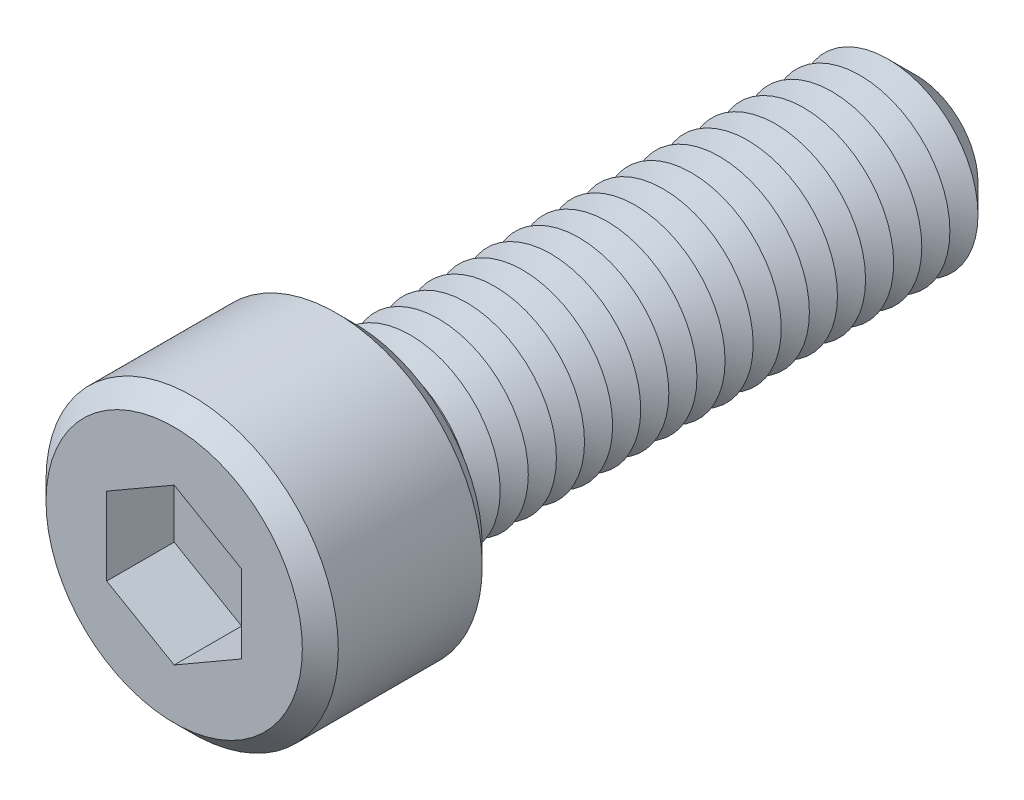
ISO-10303-21;
HEADER;
FILE_DESCRIPTION(('STEP AP214'),'2;1');
FILE_NAME('part.step','',(''),(''),'','','');
FILE_SCHEMA(('AUTOMOTIVE_DESIGN { 1 0 10303 214 1 1 1 1 }'));
ENDSEC;
DATA;
#1=APPLICATION_CONTEXT('core data for automotive mechanical design processes');
#2=APPLICATION_PROTOCOL_DEFINITION('international standard','automotive_design',2000,#1);
#3=PRODUCT_CONTEXT('',#1,'mechanical');
#4=PRODUCT('Part','Part','',(#3));
#5=PRODUCT_RELATED_PRODUCT_CATEGORY('part','',(#4));
#6=PRODUCT_DEFINITION_FORMATION('','',#4);
#7=PRODUCT_DEFINITION_CONTEXT('part definition',#1,'design');
#8=PRODUCT_DEFINITION('design','',#6,#7);
#9=PRODUCT_DEFINITION_SHAPE('','',#8);
#10=(LENGTH_UNIT() NAMED_UNIT(*) SI_UNIT(.MILLI.,.METRE.));
#11=(NAMED_UNIT(*) PLANE_ANGLE_UNIT() SI_UNIT($,.RADIAN.));
#12=(NAMED_UNIT(*) SI_UNIT($,.STERADIAN.) SOLID_ANGLE_UNIT());
#13=UNCERTAINTY_MEASURE_WITH_UNIT(LENGTH_MEASURE(1.E-05),#10,'distance_accuracy_value','');
#14=(GEOMETRIC_REPRESENTATION_CONTEXT(3) GLOBAL_UNCERTAINTY_ASSIGNED_CONTEXT((#13)) GLOBAL_UNIT_ASSIGNED_CONTEXT((#10,
#11,#12)) REPRESENTATION_CONTEXT('',''));
#15=CARTESIAN_POINT('',(0.,0.,0.));
#16=DIRECTION('',(0.,0.,1.));
#17=DIRECTION('',(1.,0.,0.));
#18=AXIS2_PLACEMENT_3D('',#15,#16,#17);
#19=CARTESIAN_POINT('',(0.,0.,8.));
#20=DIRECTION('',(0.,0.,-1.));
#21=DIRECTION('',(-1.,0.,0.));
#22=AXIS2_PLACEMENT_3D('',#19,#20,#21);
#23=CYLINDRICAL_SURFACE('',#22,6.5);
#24=CARTESIAN_POINT('',(0.,0.,0.800000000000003));
#25=DIRECTION('',(0.,0.,1.));
#26=DIRECTION('',(1.,0.,0.));
#27=AXIS2_PLACEMENT_3D('',#24,#25,#26);
#28=CIRCLE('',#27,6.5);
#29=CARTESIAN_POINT('',(6.5,0.,0.800000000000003));
#30=VERTEX_POINT('',#29);
#31=EDGE_CURVE('E328',#30,#30,#28,.T.);
#32=ORIENTED_EDGE('',*,*,#31,.T.);
#33=EDGE_LOOP('',(#32));
#34=FACE_BOUND('',#33,.T.);
#35=CARTESIAN_POINT('',(0.,0.,7.2));
#36=DIRECTION('',(0.,0.,1.));
#37=DIRECTION('',(1.,0.,0.));
#38=AXIS2_PLACEMENT_3D('',#35,#36,#37);
#39=CIRCLE('',#38,6.5);
#40=CARTESIAN_POINT('',(6.5,0.,7.2));
#41=VERTEX_POINT('',#40);
#42=EDGE_CURVE('E324',#41,#41,#39,.F.);
#43=ORIENTED_EDGE('',*,*,#42,.T.);
#44=EDGE_LOOP('',(#43));
#45=FACE_BOUND('',#44,.T.);
#46=ADVANCED_FACE('F39',(#34,#45),#23,.T.);
#47=CARTESIAN_POINT('',(0.,0.,8.));
#48=DIRECTION('',(0.,0.,1.));
#49=DIRECTION('',(1.,0.,0.));
#50=AXIS2_PLACEMENT_3D('',#47,#48,#49);
#51=PLANE('',#50);
#52=CARTESIAN_POINT('',(0.,0.,8.));
#53=DIRECTION('',(0.,0.,1.));
#54=DIRECTION('',(1.,0.,0.));
#55=AXIS2_PLACEMENT_3D('',#52,#53,#54);
#56=CIRCLE('',#55,5.69999999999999);
#57=CARTESIAN_POINT('',(5.69999999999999,0.,8.));
#58=VERTEX_POINT('',#57);
#59=EDGE_CURVE('E11',#58,#58,#56,.T.);
#60=ORIENTED_EDGE('',*,*,#59,.T.);
#61=EDGE_LOOP('',(#60));
#62=FACE_BOUND('',#61,.T.);
#63=DIRECTION('',(-0.866025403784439,0.5,0.));
#64=VECTOR('',#63,1.);
#65=CARTESIAN_POINT('',(3.,1.73205080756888,8.));
#66=LINE('',#65,#64);
#67=CARTESIAN_POINT('',(3.,1.73205080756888,8.));
#68=VERTEX_POINT('',#67);
#69=CARTESIAN_POINT('',(0.,3.46410161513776,8.));
#70=VERTEX_POINT('',#69);
#71=EDGE_CURVE('E55',#68,#70,#66,.T.);
#72=ORIENTED_EDGE('',*,*,#71,.F.);
#73=DIRECTION('',(0.,1.,0.));
#74=VECTOR('',#73,1.);
#75=CARTESIAN_POINT('',(3.,-1.73205080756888,8.));
#76=LINE('',#75,#74);
#77=CARTESIAN_POINT('',(3.,-1.73205080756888,8.));
#78=VERTEX_POINT('',#77);
#79=EDGE_CURVE('E150',#78,#68,#76,.T.);
#80=ORIENTED_EDGE('',*,*,#79,.F.);
#81=DIRECTION('',(0.866025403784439,0.5,0.));
#82=VECTOR('',#81,1.);
#83=CARTESIAN_POINT('',(0.,-3.46410161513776,8.));
#84=LINE('',#83,#82);
#85=CARTESIAN_POINT('',(0.,-3.46410161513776,8.));
#86=VERTEX_POINT('',#85);
#87=EDGE_CURVE('E147',#86,#78,#84,.T.);
#88=ORIENTED_EDGE('',*,*,#87,.F.);
#89=DIRECTION('',(0.866025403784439,-0.5,0.));
#90=VECTOR('',#89,1.);
#91=CARTESIAN_POINT('',(-3.,-1.73205080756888,8.));
#92=LINE('',#91,#90);
#93=CARTESIAN_POINT('',(-3.,-1.73205080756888,8.));
#94=VERTEX_POINT('',#93);
#95=EDGE_CURVE('E103',#94,#86,#92,.T.);
#96=ORIENTED_EDGE('',*,*,#95,.F.);
#97=DIRECTION('',(0.,-1.,0.));
#98=VECTOR('',#97,1.);
#99=CARTESIAN_POINT('',(-3.,1.73205080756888,8.));
#100=LINE('',#99,#98);
#101=CARTESIAN_POINT('',(-3.,1.73205080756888,8.));
#102=VERTEX_POINT('',#101);
#103=EDGE_CURVE('E141',#102,#94,#100,.T.);
#104=ORIENTED_EDGE('',*,*,#103,.F.);
#105=DIRECTION('',(-0.866025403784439,-0.5,0.));
#106=VECTOR('',#105,1.);
#107=CARTESIAN_POINT('',(0.,3.46410161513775,8.));
#108=LINE('',#107,#106);
#109=EDGE_CURVE('E136',#70,#102,#108,.T.);
#110=ORIENTED_EDGE('',*,*,#109,.F.);
#111=EDGE_LOOP('',(#72,#80,#88,#96,#104,#110));
#112=FACE_BOUND('',#111,.T.);
#113=ADVANCED_FACE('F346',(#62,#112),#51,.T.);
#114=CARTESIAN_POINT('',(0.,0.,0.));
#115=DIRECTION('',(0.,0.,1.));
#116=DIRECTION('',(1.,0.,0.));
#117=AXIS2_PLACEMENT_3D('',#114,#115,#116);
#118=PLANE('',#117);
#119=CARTESIAN_POINT('',(0.,0.,0.));
#120=DIRECTION('',(0.,0.,1.));
#121=DIRECTION('',(1.,0.,0.));
#122=AXIS2_PLACEMENT_3D('',#119,#120,#121);
#123=CIRCLE('',#122,5.7);
#124=CARTESIAN_POINT('',(5.7,0.,0.));
#125=VERTEX_POINT('',#124);
#126=EDGE_CURVE('E48',#125,#125,#123,.F.);
#127=ORIENTED_EDGE('',*,*,#126,.T.);
#128=EDGE_LOOP('',(#127));
#129=FACE_BOUND('',#128,.T.);
#130=CARTESIAN_POINT('',(0.,0.,0.));
#131=DIRECTION('',(0.,0.,1.));
#132=DIRECTION('',(1.,0.,0.));
#133=AXIS2_PLACEMENT_3D('',#130,#131,#132);
#134=CIRCLE('',#133,4.);
#135=CARTESIAN_POINT('',(4.,0.,0.));
#136=VERTEX_POINT('',#135);
#137=EDGE_CURVE('E316',#136,#136,#134,.T.);
#138=ORIENTED_EDGE('',*,*,#137,.T.);
#139=EDGE_LOOP('',(#138));
#140=FACE_BOUND('',#139,.T.);
#141=ADVANCED_FACE('F335',(#129,#140),#118,.F.);
#142=CARTESIAN_POINT('',(0.,0.,0.));
#143=DIRECTION('',(0.,0.,1.));
#144=DIRECTION('',(1.,0.,0.));
#145=AXIS2_PLACEMENT_3D('',#142,#143,#144);
#146=CONICAL_SURFACE('',#145,4.,1.0471975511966);
#147=CARTESIAN_POINT('',(0.,0.,-0.625000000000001));
#148=DIRECTION('',(0.,0.,1.));
#149=DIRECTION('',(1.,0.,0.));
#150=AXIS2_PLACEMENT_3D('',#147,#148,#149);
#151=CIRCLE('',#150,2.91746824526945);
#152=CARTESIAN_POINT('',(2.91746824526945,0.,-0.625000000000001));
#153=VERTEX_POINT('',#152);
#154=EDGE_CURVE('E312',#153,#153,#151,.T.);
#155=ORIENTED_EDGE('',*,*,#154,.T.);
#156=EDGE_LOOP('',(#155));
#157=FACE_BOUND('',#156,.T.);
#158=ORIENTED_EDGE('',*,*,#137,.F.);
#159=EDGE_LOOP('',(#158));
#160=FACE_BOUND('',#159,.T.);
#161=ADVANCED_FACE('F548',(#157,#160),#146,.T.);
#162=CARTESIAN_POINT('',(0.,0.,-0.625000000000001));
#163=DIRECTION('',(0.,0.,-1.));
#164=DIRECTION('',(-1.,0.,0.));
#165=AXIS2_PLACEMENT_3D('',#162,#163,#164);
#166=CONICAL_SURFACE('',#165,2.91746824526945,1.0471975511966);
#167=CARTESIAN_POINT('',(0.,0.,-1.25));
#168=DIRECTION('',(0.,0.,1.));
#169=DIRECTION('',(1.,0.,0.));
#170=AXIS2_PLACEMENT_3D('',#167,#168,#169);
#171=CIRCLE('',#170,4.);
#172=CARTESIAN_POINT('',(4.,0.,-1.25));
#173=VERTEX_POINT('',#172);
#174=EDGE_CURVE('E308',#173,#173,#171,.T.);
#175=ORIENTED_EDGE('',*,*,#174,.T.);
#176=EDGE_LOOP('',(#175));
#177=FACE_BOUND('',#176,.T.);
#178=ORIENTED_EDGE('',*,*,#154,.F.);
#179=EDGE_LOOP('',(#178));
#180=FACE_BOUND('',#179,.T.);
#181=ADVANCED_FACE('F544',(#177,#180),#166,.T.);
#182=CARTESIAN_POINT('',(0.,0.,-1.25));
#183=DIRECTION('',(0.,0.,1.));
#184=DIRECTION('',(1.,0.,0.));
#185=AXIS2_PLACEMENT_3D('',#182,#183,#184);
#186=CONICAL_SURFACE('',#185,4.,1.0471975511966);
#187=CARTESIAN_POINT('',(0.,0.,-1.875));
#188=DIRECTION('',(0.,0.,1.));
#189=DIRECTION('',(1.,0.,0.));
#190=AXIS2_PLACEMENT_3D('',#187,#188,#189);
#191=CIRCLE('',#190,2.91746824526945);
#192=CARTESIAN_POINT('',(2.91746824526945,0.,-1.875));
#193=VERTEX_POINT('',#192);
#194=EDGE_CURVE('E304',#193,#193,#191,.T.);
#195=ORIENTED_EDGE('',*,*,#194,.T.);
#196=EDGE_LOOP('',(#195));
#197=FACE_BOUND('',#196,.T.);
#198=ORIENTED_EDGE('',*,*,#174,.F.);
#199=EDGE_LOOP('',(#198));
#200=FACE_BOUND('',#199,.T.);
#201=ADVANCED_FACE('F540',(#197,#200),#186,.T.);
#202=CARTESIAN_POINT('',(0.,0.,-1.875));
#203=DIRECTION('',(0.,0.,-1.));
#204=DIRECTION('',(-1.,0.,0.));
#205=AXIS2_PLACEMENT_3D('',#202,#203,#204);
#206=CONICAL_SURFACE('',#205,2.91746824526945,1.0471975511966);
#207=CARTESIAN_POINT('',(0.,0.,-2.5));
#208=DIRECTION('',(0.,0.,1.));
#209=DIRECTION('',(1.,0.,0.));
#210=AXIS2_PLACEMENT_3D('',#207,#208,#209);
#211=CIRCLE('',#210,4.);
#212=CARTESIAN_POINT('',(4.,0.,-2.5));
#213=VERTEX_POINT('',#212);
#214=EDGE_CURVE('E300',#213,#213,#211,.T.);
#215=ORIENTED_EDGE('',*,*,#214,.T.);
#216=EDGE_LOOP('',(#215));
#217=FACE_BOUND('',#216,.T.);
#218=ORIENTED_EDGE('',*,*,#194,.F.);
#219=EDGE_LOOP('',(#218));
#220=FACE_BOUND('',#219,.T.);
#221=ADVANCED_FACE('F536',(#217,#220),#206,.T.);
#222=CARTESIAN_POINT('',(0.,0.,-2.5));
#223=DIRECTION('',(0.,0.,1.));
#224=DIRECTION('',(1.,0.,0.));
#225=AXIS2_PLACEMENT_3D('',#222,#223,#224);
#226=CONICAL_SURFACE('',#225,4.,1.0471975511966);
#227=CARTESIAN_POINT('',(0.,0.,-3.125));
#228=DIRECTION('',(0.,0.,1.));
#229=DIRECTION('',(1.,0.,0.));
#230=AXIS2_PLACEMENT_3D('',#227,#228,#229);
#231=CIRCLE('',#230,2.91746824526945);
#232=CARTESIAN_POINT('',(2.91746824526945,0.,-3.125));
#233=VERTEX_POINT('',#232);
#234=EDGE_CURVE('E296',#233,#233,#231,.T.);
#235=ORIENTED_EDGE('',*,*,#234,.T.);
#236=EDGE_LOOP('',(#235));
#237=FACE_BOUND('',#236,.T.);
#238=ORIENTED_EDGE('',*,*,#214,.F.);
#239=EDGE_LOOP('',(#238));
#240=FACE_BOUND('',#239,.T.);
#241=ADVANCED_FACE('F532',(#237,#240),#226,.T.);
#242=CARTESIAN_POINT('',(0.,0.,-3.125));
#243=DIRECTION('',(0.,0.,-1.));
#244=DIRECTION('',(-1.,0.,0.));
#245=AXIS2_PLACEMENT_3D('',#242,#243,#244);
#246=CONICAL_SURFACE('',#245,2.91746824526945,1.0471975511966);
#247=CARTESIAN_POINT('',(0.,0.,-3.75));
#248=DIRECTION('',(0.,0.,1.));
#249=DIRECTION('',(1.,0.,0.));
#250=AXIS2_PLACEMENT_3D('',#247,#248,#249);
#251=CIRCLE('',#250,4.);
#252=CARTESIAN_POINT('',(4.,0.,-3.75));
#253=VERTEX_POINT('',#252);
#254=EDGE_CURVE('E292',#253,#253,#251,.T.);
#255=ORIENTED_EDGE('',*,*,#254,.T.);
#256=EDGE_LOOP('',(#255));
#257=FACE_BOUND('',#256,.T.);
#258=ORIENTED_EDGE('',*,*,#234,.F.);
#259=EDGE_LOOP('',(#258));
#260=FACE_BOUND('',#259,.T.);
#261=ADVANCED_FACE('F528',(#257,#260),#246,.T.);
#262=CARTESIAN_POINT('',(0.,0.,-3.75));
#263=DIRECTION('',(0.,0.,1.));
#264=DIRECTION('',(1.,0.,0.));
#265=AXIS2_PLACEMENT_3D('',#262,#263,#264);
#266=CONICAL_SURFACE('',#265,4.,1.0471975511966);
#267=CARTESIAN_POINT('',(0.,0.,-4.375));
#268=DIRECTION('',(0.,0.,1.));
#269=DIRECTION('',(1.,0.,0.));
#270=AXIS2_PLACEMENT_3D('',#267,#268,#269);
#271=CIRCLE('',#270,2.91746824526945);
#272=CARTESIAN_POINT('',(2.91746824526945,0.,-4.375));
#273=VERTEX_POINT('',#272);
#274=EDGE_CURVE('E288',#273,#273,#271,.T.);
#275=ORIENTED_EDGE('',*,*,#274,.T.);
#276=EDGE_LOOP('',(#275));
#277=FACE_BOUND('',#276,.T.);
#278=ORIENTED_EDGE('',*,*,#254,.F.);
#279=EDGE_LOOP('',(#278));
#280=FACE_BOUND('',#279,.T.);
#281=ADVANCED_FACE('F524',(#277,#280),#266,.T.);
#282=CARTESIAN_POINT('',(0.,0.,-4.375));
#283=DIRECTION('',(0.,0.,-1.));
#284=DIRECTION('',(-1.,0.,0.));
#285=AXIS2_PLACEMENT_3D('',#282,#283,#284);
#286=CONICAL_SURFACE('',#285,2.91746824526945,1.0471975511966);
#287=CARTESIAN_POINT('',(0.,0.,-5.));
#288=DIRECTION('',(0.,0.,1.));
#289=DIRECTION('',(1.,0.,0.));
#290=AXIS2_PLACEMENT_3D('',#287,#288,#289);
#291=CIRCLE('',#290,4.);
#292=CARTESIAN_POINT('',(4.,0.,-5.));
#293=VERTEX_POINT('',#292);
#294=EDGE_CURVE('E284',#293,#293,#291,.T.);
#295=ORIENTED_EDGE('',*,*,#294,.T.);
#296=EDGE_LOOP('',(#295));
#297=FACE_BOUND('',#296,.T.);
#298=ORIENTED_EDGE('',*,*,#274,.F.);
#299=EDGE_LOOP('',(#298));
#300=FACE_BOUND('',#299,.T.);
#301=ADVANCED_FACE('F520',(#297,#300),#286,.T.);
#302=CARTESIAN_POINT('',(0.,0.,-5.));
#303=DIRECTION('',(0.,0.,1.));
#304=DIRECTION('',(1.,0.,0.));
#305=AXIS2_PLACEMENT_3D('',#302,#303,#304);
#306=CONICAL_SURFACE('',#305,4.,1.0471975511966);
#307=CARTESIAN_POINT('',(0.,0.,-5.625));
#308=DIRECTION('',(0.,0.,1.));
#309=DIRECTION('',(1.,0.,0.));
#310=AXIS2_PLACEMENT_3D('',#307,#308,#309);
#311=CIRCLE('',#310,2.91746824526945);
#312=CARTESIAN_POINT('',(2.91746824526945,0.,-5.625));
#313=VERTEX_POINT('',#312);
#314=EDGE_CURVE('E280',#313,#313,#311,.T.);
#315=ORIENTED_EDGE('',*,*,#314,.T.);
#316=EDGE_LOOP('',(#315));
#317=FACE_BOUND('',#316,.T.);
#318=ORIENTED_EDGE('',*,*,#294,.F.);
#319=EDGE_LOOP('',(#318));
#320=FACE_BOUND('',#319,.T.);
#321=ADVANCED_FACE('F516',(#317,#320),#306,.T.);
#322=CARTESIAN_POINT('',(0.,0.,-5.625));
#323=DIRECTION('',(0.,0.,-1.));
#324=DIRECTION('',(-1.,0.,0.));
#325=AXIS2_PLACEMENT_3D('',#322,#323,#324);
#326=CONICAL_SURFACE('',#325,2.91746824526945,1.0471975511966);
#327=CARTESIAN_POINT('',(0.,0.,-6.25));
#328=DIRECTION('',(0.,0.,1.));
#329=DIRECTION('',(1.,0.,0.));
#330=AXIS2_PLACEMENT_3D('',#327,#328,#329);
#331=CIRCLE('',#330,4.);
#332=CARTESIAN_POINT('',(4.,0.,-6.25));
#333=VERTEX_POINT('',#332);
#334=EDGE_CURVE('E276',#333,#333,#331,.T.);
#335=ORIENTED_EDGE('',*,*,#334,.T.);
#336=EDGE_LOOP('',(#335));
#337=FACE_BOUND('',#336,.T.);
#338=ORIENTED_EDGE('',*,*,#314,.F.);
#339=EDGE_LOOP('',(#338));
#340=FACE_BOUND('',#339,.T.);
#341=ADVANCED_FACE('F512',(#337,#340),#326,.T.);
#342=CARTESIAN_POINT('',(0.,0.,-6.25));
#343=DIRECTION('',(0.,0.,1.));
#344=DIRECTION('',(1.,0.,0.));
#345=AXIS2_PLACEMENT_3D('',#342,#343,#344);
#346=CONICAL_SURFACE('',#345,4.,1.0471975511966);
#347=CARTESIAN_POINT('',(0.,0.,-6.875));
#348=DIRECTION('',(0.,0.,1.));
#349=DIRECTION('',(1.,0.,0.));
#350=AXIS2_PLACEMENT_3D('',#347,#348,#349);
#351=CIRCLE('',#350,2.91746824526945);
#352=CARTESIAN_POINT('',(2.91746824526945,0.,-6.875));
#353=VERTEX_POINT('',#352);
#354=EDGE_CURVE('E272',#353,#353,#351,.T.);
#355=ORIENTED_EDGE('',*,*,#354,.T.);
#356=EDGE_LOOP('',(#355));
#357=FACE_BOUND('',#356,.T.);
#358=ORIENTED_EDGE('',*,*,#334,.F.);
#359=EDGE_LOOP('',(#358));
#360=FACE_BOUND('',#359,.T.);
#361=ADVANCED_FACE('F508',(#357,#360),#346,.T.);
#362=CARTESIAN_POINT('',(0.,0.,-6.875));
#363=DIRECTION('',(0.,0.,-1.));
#364=DIRECTION('',(-1.,0.,0.));
#365=AXIS2_PLACEMENT_3D('',#362,#363,#364);
#366=CONICAL_SURFACE('',#365,2.91746824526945,1.0471975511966);
#367=CARTESIAN_POINT('',(0.,0.,-7.5));
#368=DIRECTION('',(0.,0.,1.));
#369=DIRECTION('',(1.,0.,0.));
#370=AXIS2_PLACEMENT_3D('',#367,#368,#369);
#371=CIRCLE('',#370,4.);
#372=CARTESIAN_POINT('',(4.,0.,-7.5));
#373=VERTEX_POINT('',#372);
#374=EDGE_CURVE('E268',#373,#373,#371,.T.);
#375=ORIENTED_EDGE('',*,*,#374,.T.);
#376=EDGE_LOOP('',(#375));
#377=FACE_BOUND('',#376,.T.);
#378=ORIENTED_EDGE('',*,*,#354,.F.);
#379=EDGE_LOOP('',(#378));
#380=FACE_BOUND('',#379,.T.);
#381=ADVANCED_FACE('F504',(#377,#380),#366,.T.);
#382=CARTESIAN_POINT('',(0.,0.,-7.5));
#383=DIRECTION('',(0.,0.,1.));
#384=DIRECTION('',(1.,0.,0.));
#385=AXIS2_PLACEMENT_3D('',#382,#383,#384);
#386=CONICAL_SURFACE('',#385,4.,1.0471975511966);
#387=CARTESIAN_POINT('',(0.,0.,-8.125));
#388=DIRECTION('',(0.,0.,1.));
#389=DIRECTION('',(1.,0.,0.));
#390=AXIS2_PLACEMENT_3D('',#387,#388,#389);
#391=CIRCLE('',#390,2.91746824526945);
#392=CARTESIAN_POINT('',(2.91746824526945,0.,-8.125));
#393=VERTEX_POINT('',#392);
#394=EDGE_CURVE('E264',#393,#393,#391,.T.);
#395=ORIENTED_EDGE('',*,*,#394,.T.);
#396=EDGE_LOOP('',(#395));
#397=FACE_BOUND('',#396,.T.);
#398=ORIENTED_EDGE('',*,*,#374,.F.);
#399=EDGE_LOOP('',(#398));
#400=FACE_BOUND('',#399,.T.);
#401=ADVANCED_FACE('F500',(#397,#400),#386,.T.);
#402=CARTESIAN_POINT('',(0.,0.,-8.125));
#403=DIRECTION('',(0.,0.,-1.));
#404=DIRECTION('',(-1.,0.,0.));
#405=AXIS2_PLACEMENT_3D('',#402,#403,#404);
#406=CONICAL_SURFACE('',#405,2.91746824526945,1.0471975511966);
#407=CARTESIAN_POINT('',(0.,0.,-8.75));
#408=DIRECTION('',(0.,0.,1.));
#409=DIRECTION('',(1.,0.,0.));
#410=AXIS2_PLACEMENT_3D('',#407,#408,#409);
#411=CIRCLE('',#410,4.);
#412=CARTESIAN_POINT('',(4.,0.,-8.75));
#413=VERTEX_POINT('',#412);
#414=EDGE_CURVE('E260',#413,#413,#411,.T.);
#415=ORIENTED_EDGE('',*,*,#414,.T.);
#416=EDGE_LOOP('',(#415));
#417=FACE_BOUND('',#416,.T.);
#418=ORIENTED_EDGE('',*,*,#394,.F.);
#419=EDGE_LOOP('',(#418));
#420=FACE_BOUND('',#419,.T.);
#421=ADVANCED_FACE('F496',(#417,#420),#406,.T.);
#422=CARTESIAN_POINT('',(0.,0.,-8.75));
#423=DIRECTION('',(0.,0.,1.));
#424=DIRECTION('',(1.,0.,0.));
#425=AXIS2_PLACEMENT_3D('',#422,#423,#424);
#426=CONICAL_SURFACE('',#425,4.,1.0471975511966);
#427=CARTESIAN_POINT('',(0.,0.,-9.375));
#428=DIRECTION('',(0.,0.,1.));
#429=DIRECTION('',(1.,0.,0.));
#430=AXIS2_PLACEMENT_3D('',#427,#428,#429);
#431=CIRCLE('',#430,2.91746824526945);
#432=CARTESIAN_POINT('',(2.91746824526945,0.,-9.375));
#433=VERTEX_POINT('',#432);
#434=EDGE_CURVE('E256',#433,#433,#431,.T.);
#435=ORIENTED_EDGE('',*,*,#434,.T.);
#436=EDGE_LOOP('',(#435));
#437=FACE_BOUND('',#436,.T.);
#438=ORIENTED_EDGE('',*,*,#414,.F.);
#439=EDGE_LOOP('',(#438));
#440=FACE_BOUND('',#439,.T.);
#441=ADVANCED_FACE('F492',(#437,#440),#426,.T.);
#442=CARTESIAN_POINT('',(0.,0.,-9.375));
#443=DIRECTION('',(0.,0.,-1.));
#444=DIRECTION('',(-1.,0.,0.));
#445=AXIS2_PLACEMENT_3D('',#442,#443,#444);
#446=CONICAL_SURFACE('',#445,2.91746824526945,1.0471975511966);
#447=CARTESIAN_POINT('',(0.,0.,-10.));
#448=DIRECTION('',(0.,0.,1.));
#449=DIRECTION('',(1.,0.,0.));
#450=AXIS2_PLACEMENT_3D('',#447,#448,#449);
#451=CIRCLE('',#450,4.);
#452=CARTESIAN_POINT('',(4.,0.,-10.));
#453=VERTEX_POINT('',#452);
#454=EDGE_CURVE('E252',#453,#453,#451,.T.);
#455=ORIENTED_EDGE('',*,*,#454,.T.);
#456=EDGE_LOOP('',(#455));
#457=FACE_BOUND('',#456,.T.);
#458=ORIENTED_EDGE('',*,*,#434,.F.);
#459=EDGE_LOOP('',(#458));
#460=FACE_BOUND('',#459,.T.);
#461=ADVANCED_FACE('F488',(#457,#460),#446,.T.);
#462=CARTESIAN_POINT('',(0.,0.,-10.));
#463=DIRECTION('',(0.,0.,1.));
#464=DIRECTION('',(1.,0.,0.));
#465=AXIS2_PLACEMENT_3D('',#462,#463,#464);
#466=CONICAL_SURFACE('',#465,4.,1.0471975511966);
#467=CARTESIAN_POINT('',(0.,0.,-10.625));
#468=DIRECTION('',(0.,0.,1.));
#469=DIRECTION('',(1.,0.,0.));
#470=AXIS2_PLACEMENT_3D('',#467,#468,#469);
#471=CIRCLE('',#470,2.91746824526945);
#472=CARTESIAN_POINT('',(2.91746824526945,0.,-10.625));
#473=VERTEX_POINT('',#472);
#474=EDGE_CURVE('E248',#473,#473,#471,.T.);
#475=ORIENTED_EDGE('',*,*,#474,.T.);
#476=EDGE_LOOP('',(#475));
#477=FACE_BOUND('',#476,.T.);
#478=ORIENTED_EDGE('',*,*,#454,.F.);
#479=EDGE_LOOP('',(#478));
#480=FACE_BOUND('',#479,.T.);
#481=ADVANCED_FACE('F484',(#477,#480),#466,.T.);
#482=CARTESIAN_POINT('',(0.,0.,-10.625));
#483=DIRECTION('',(0.,0.,-1.));
#484=DIRECTION('',(-1.,0.,0.));
#485=AXIS2_PLACEMENT_3D('',#482,#483,#484);
#486=CONICAL_SURFACE('',#485,2.91746824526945,1.0471975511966);
#487=CARTESIAN_POINT('',(0.,0.,-11.25));
#488=DIRECTION('',(0.,0.,1.));
#489=DIRECTION('',(1.,0.,0.));
#490=AXIS2_PLACEMENT_3D('',#487,#488,#489);
#491=CIRCLE('',#490,4.);
#492=CARTESIAN_POINT('',(4.,0.,-11.25));
#493=VERTEX_POINT('',#492);
#494=EDGE_CURVE('E244',#493,#493,#491,.T.);
#495=ORIENTED_EDGE('',*,*,#494,.T.);
#496=EDGE_LOOP('',(#495));
#497=FACE_BOUND('',#496,.T.);
#498=ORIENTED_EDGE('',*,*,#474,.F.);
#499=EDGE_LOOP('',(#498));
#500=FACE_BOUND('',#499,.T.);
#501=ADVANCED_FACE('F480',(#497,#500),#486,.T.);
#502=CARTESIAN_POINT('',(0.,0.,-11.25));
#503=DIRECTION('',(0.,0.,1.));
#504=DIRECTION('',(1.,0.,0.));
#505=AXIS2_PLACEMENT_3D('',#502,#503,#504);
#506=CONICAL_SURFACE('',#505,4.,1.0471975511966);
#507=CARTESIAN_POINT('',(0.,0.,-11.875));
#508=DIRECTION('',(0.,0.,1.));
#509=DIRECTION('',(1.,0.,0.));
#510=AXIS2_PLACEMENT_3D('',#507,#508,#509);
#511=CIRCLE('',#510,2.91746824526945);
#512=CARTESIAN_POINT('',(2.91746824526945,0.,-11.875));
#513=VERTEX_POINT('',#512);
#514=EDGE_CURVE('E240',#513,#513,#511,.T.);
#515=ORIENTED_EDGE('',*,*,#514,.T.);
#516=EDGE_LOOP('',(#515));
#517=FACE_BOUND('',#516,.T.);
#518=ORIENTED_EDGE('',*,*,#494,.F.);
#519=EDGE_LOOP('',(#518));
#520=FACE_BOUND('',#519,.T.);
#521=ADVANCED_FACE('F476',(#517,#520),#506,.T.);
#522=CARTESIAN_POINT('',(0.,0.,-11.875));
#523=DIRECTION('',(0.,0.,-1.));
#524=DIRECTION('',(-1.,0.,0.));
#525=AXIS2_PLACEMENT_3D('',#522,#523,#524);
#526=CONICAL_SURFACE('',#525,2.91746824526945,1.0471975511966);
#527=CARTESIAN_POINT('',(0.,0.,-12.5));
#528=DIRECTION('',(0.,0.,1.));
#529=DIRECTION('',(1.,0.,0.));
#530=AXIS2_PLACEMENT_3D('',#527,#528,#529);
#531=CIRCLE('',#530,4.);
#532=CARTESIAN_POINT('',(4.,0.,-12.5));
#533=VERTEX_POINT('',#532);
#534=EDGE_CURVE('E236',#533,#533,#531,.T.);
#535=ORIENTED_EDGE('',*,*,#534,.T.);
#536=EDGE_LOOP('',(#535));
#537=FACE_BOUND('',#536,.T.);
#538=ORIENTED_EDGE('',*,*,#514,.F.);
#539=EDGE_LOOP('',(#538));
#540=FACE_BOUND('',#539,.T.);
#541=ADVANCED_FACE('F472',(#537,#540),#526,.T.);
#542=CARTESIAN_POINT('',(0.,0.,-12.5));
#543=DIRECTION('',(0.,0.,1.));
#544=DIRECTION('',(1.,0.,0.));
#545=AXIS2_PLACEMENT_3D('',#542,#543,#544);
#546=CONICAL_SURFACE('',#545,4.,1.0471975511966);
#547=CARTESIAN_POINT('',(0.,0.,-13.125));
#548=DIRECTION('',(0.,0.,1.));
#549=DIRECTION('',(1.,0.,0.));
#550=AXIS2_PLACEMENT_3D('',#547,#548,#549);
#551=CIRCLE('',#550,2.91746824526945);
#552=CARTESIAN_POINT('',(2.91746824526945,0.,-13.125));
#553=VERTEX_POINT('',#552);
#554=EDGE_CURVE('E232',#553,#553,#551,.T.);
#555=ORIENTED_EDGE('',*,*,#554,.T.);
#556=EDGE_LOOP('',(#555));
#557=FACE_BOUND('',#556,.T.);
#558=ORIENTED_EDGE('',*,*,#534,.F.);
#559=EDGE_LOOP('',(#558));
#560=FACE_BOUND('',#559,.T.);
#561=ADVANCED_FACE('F468',(#557,#560),#546,.T.);
#562=CARTESIAN_POINT('',(0.,0.,-13.125));
#563=DIRECTION('',(0.,0.,-1.));
#564=DIRECTION('',(-1.,0.,0.));
#565=AXIS2_PLACEMENT_3D('',#562,#563,#564);
#566=CONICAL_SURFACE('',#565,2.91746824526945,1.0471975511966);
#567=CARTESIAN_POINT('',(0.,0.,-13.75));
#568=DIRECTION('',(0.,0.,1.));
#569=DIRECTION('',(1.,0.,0.));
#570=AXIS2_PLACEMENT_3D('',#567,#568,#569);
#571=CIRCLE('',#570,4.);
#572=CARTESIAN_POINT('',(4.,0.,-13.75));
#573=VERTEX_POINT('',#572);
#574=EDGE_CURVE('E228',#573,#573,#571,.T.);
#575=ORIENTED_EDGE('',*,*,#574,.T.);
#576=EDGE_LOOP('',(#575));
#577=FACE_BOUND('',#576,.T.);
#578=ORIENTED_EDGE('',*,*,#554,.F.);
#579=EDGE_LOOP('',(#578));
#580=FACE_BOUND('',#579,.T.);
#581=ADVANCED_FACE('F464',(#577,#580),#566,.T.);
#582=CARTESIAN_POINT('',(0.,0.,-13.75));
#583=DIRECTION('',(0.,0.,1.));
#584=DIRECTION('',(1.,0.,0.));
#585=AXIS2_PLACEMENT_3D('',#582,#583,#584);
#586=CONICAL_SURFACE('',#585,4.,1.0471975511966);
#587=CARTESIAN_POINT('',(0.,0.,-14.375));
#588=DIRECTION('',(0.,0.,1.));
#589=DIRECTION('',(1.,0.,0.));
#590=AXIS2_PLACEMENT_3D('',#587,#588,#589);
#591=CIRCLE('',#590,2.91746824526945);
#592=CARTESIAN_POINT('',(2.91746824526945,0.,-14.375));
#593=VERTEX_POINT('',#592);
#594=EDGE_CURVE('E224',#593,#593,#591,.T.);
#595=ORIENTED_EDGE('',*,*,#594,.T.);
#596=EDGE_LOOP('',(#595));
#597=FACE_BOUND('',#596,.T.);
#598=ORIENTED_EDGE('',*,*,#574,.F.);
#599=EDGE_LOOP('',(#598));
#600=FACE_BOUND('',#599,.T.);
#601=ADVANCED_FACE('F460',(#597,#600),#586,.T.);
#602=CARTESIAN_POINT('',(0.,0.,-14.375));
#603=DIRECTION('',(0.,0.,-1.));
#604=DIRECTION('',(-1.,0.,0.));
#605=AXIS2_PLACEMENT_3D('',#602,#603,#604);
#606=CONICAL_SURFACE('',#605,2.91746824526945,1.0471975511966);
#607=CARTESIAN_POINT('',(0.,0.,-15.));
#608=DIRECTION('',(0.,0.,1.));
#609=DIRECTION('',(1.,0.,0.));
#610=AXIS2_PLACEMENT_3D('',#607,#608,#609);
#611=CIRCLE('',#610,4.);
#612=CARTESIAN_POINT('',(4.,0.,-15.));
#613=VERTEX_POINT('',#612);
#614=EDGE_CURVE('E220',#613,#613,#611,.T.);
#615=ORIENTED_EDGE('',*,*,#614,.T.);
#616=EDGE_LOOP('',(#615));
#617=FACE_BOUND('',#616,.T.);
#618=ORIENTED_EDGE('',*,*,#594,.F.);
#619=EDGE_LOOP('',(#618));
#620=FACE_BOUND('',#619,.T.);
#621=ADVANCED_FACE('F456',(#617,#620),#606,.T.);
#622=CARTESIAN_POINT('',(0.,0.,-15.));
#623=DIRECTION('',(0.,0.,1.));
#624=DIRECTION('',(1.,0.,0.));
#625=AXIS2_PLACEMENT_3D('',#622,#623,#624);
#626=CONICAL_SURFACE('',#625,4.,1.0471975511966);
#627=CARTESIAN_POINT('',(0.,0.,-15.625));
#628=DIRECTION('',(0.,0.,1.));
#629=DIRECTION('',(1.,0.,0.));
#630=AXIS2_PLACEMENT_3D('',#627,#628,#629);
#631=CIRCLE('',#630,2.91746824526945);
#632=CARTESIAN_POINT('',(2.91746824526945,0.,-15.625));
#633=VERTEX_POINT('',#632);
#634=EDGE_CURVE('E216',#633,#633,#631,.T.);
#635=ORIENTED_EDGE('',*,*,#634,.T.);
#636=EDGE_LOOP('',(#635));
#637=FACE_BOUND('',#636,.T.);
#638=ORIENTED_EDGE('',*,*,#614,.F.);
#639=EDGE_LOOP('',(#638));
#640=FACE_BOUND('',#639,.T.);
#641=ADVANCED_FACE('F452',(#637,#640),#626,.T.);
#642=CARTESIAN_POINT('',(0.,0.,-15.625));
#643=DIRECTION('',(0.,0.,-1.));
#644=DIRECTION('',(-1.,0.,0.));
#645=AXIS2_PLACEMENT_3D('',#642,#643,#644);
#646=CONICAL_SURFACE('',#645,2.91746824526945,1.0471975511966);
#647=CARTESIAN_POINT('',(0.,0.,-16.25));
#648=DIRECTION('',(0.,0.,1.));
#649=DIRECTION('',(1.,0.,0.));
#650=AXIS2_PLACEMENT_3D('',#647,#648,#649);
#651=CIRCLE('',#650,4.);
#652=CARTESIAN_POINT('',(4.,0.,-16.25));
#653=VERTEX_POINT('',#652);
#654=EDGE_CURVE('E212',#653,#653,#651,.T.);
#655=ORIENTED_EDGE('',*,*,#654,.T.);
#656=EDGE_LOOP('',(#655));
#657=FACE_BOUND('',#656,.T.);
#658=ORIENTED_EDGE('',*,*,#634,.F.);
#659=EDGE_LOOP('',(#658));
#660=FACE_BOUND('',#659,.T.);
#661=ADVANCED_FACE('F448',(#657,#660),#646,.T.);
#662=CARTESIAN_POINT('',(0.,0.,-16.25));
#663=DIRECTION('',(0.,0.,1.));
#664=DIRECTION('',(1.,0.,0.));
#665=AXIS2_PLACEMENT_3D('',#662,#663,#664);
#666=CONICAL_SURFACE('',#665,4.,1.0471975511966);
#667=CARTESIAN_POINT('',(0.,0.,-16.875));
#668=DIRECTION('',(0.,0.,1.));
#669=DIRECTION('',(1.,0.,0.));
#670=AXIS2_PLACEMENT_3D('',#667,#668,#669);
#671=CIRCLE('',#670,2.91746824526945);
#672=CARTESIAN_POINT('',(2.91746824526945,0.,-16.875));
#673=VERTEX_POINT('',#672);
#674=EDGE_CURVE('E208',#673,#673,#671,.T.);
#675=ORIENTED_EDGE('',*,*,#674,.T.);
#676=EDGE_LOOP('',(#675));
#677=FACE_BOUND('',#676,.T.);
#678=ORIENTED_EDGE('',*,*,#654,.F.);
#679=EDGE_LOOP('',(#678));
#680=FACE_BOUND('',#679,.T.);
#681=ADVANCED_FACE('F444',(#677,#680),#666,.T.);
#682=CARTESIAN_POINT('',(0.,0.,-16.875));
#683=DIRECTION('',(0.,0.,-1.));
#684=DIRECTION('',(-1.,0.,0.));
#685=AXIS2_PLACEMENT_3D('',#682,#683,#684);
#686=CONICAL_SURFACE('',#685,2.91746824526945,1.0471975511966);
#687=CARTESIAN_POINT('',(0.,0.,-17.5));
#688=DIRECTION('',(0.,0.,1.));
#689=DIRECTION('',(1.,0.,0.));
#690=AXIS2_PLACEMENT_3D('',#687,#688,#689);
#691=CIRCLE('',#690,4.);
#692=CARTESIAN_POINT('',(4.,0.,-17.5));
#693=VERTEX_POINT('',#692);
#694=EDGE_CURVE('E204',#693,#693,#691,.T.);
#695=ORIENTED_EDGE('',*,*,#694,.T.);
#696=EDGE_LOOP('',(#695));
#697=FACE_BOUND('',#696,.T.);
#698=ORIENTED_EDGE('',*,*,#674,.F.);
#699=EDGE_LOOP('',(#698));
#700=FACE_BOUND('',#699,.T.);
#701=ADVANCED_FACE('F440',(#697,#700),#686,.T.);
#702=CARTESIAN_POINT('',(0.,0.,-17.5));
#703=DIRECTION('',(0.,0.,1.));
#704=DIRECTION('',(1.,0.,0.));
#705=AXIS2_PLACEMENT_3D('',#702,#703,#704);
#706=CONICAL_SURFACE('',#705,4.,1.0471975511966);
#707=CARTESIAN_POINT('',(0.,0.,-18.125));
#708=DIRECTION('',(0.,0.,1.));
#709=DIRECTION('',(1.,0.,0.));
#710=AXIS2_PLACEMENT_3D('',#707,#708,#709);
#711=CIRCLE('',#710,2.91746824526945);
#712=CARTESIAN_POINT('',(2.91746824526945,0.,-18.125));
#713=VERTEX_POINT('',#712);
#714=EDGE_CURVE('E200',#713,#713,#711,.T.);
#715=ORIENTED_EDGE('',*,*,#714,.T.);
#716=EDGE_LOOP('',(#715));
#717=FACE_BOUND('',#716,.T.);
#718=ORIENTED_EDGE('',*,*,#694,.F.);
#719=EDGE_LOOP('',(#718));
#720=FACE_BOUND('',#719,.T.);
#721=ADVANCED_FACE('F436',(#717,#720),#706,.T.);
#722=CARTESIAN_POINT('',(0.,0.,-18.125));
#723=DIRECTION('',(0.,0.,-1.));
#724=DIRECTION('',(-1.,0.,0.));
#725=AXIS2_PLACEMENT_3D('',#722,#723,#724);
#726=CONICAL_SURFACE('',#725,2.91746824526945,1.0471975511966);
#727=CARTESIAN_POINT('',(0.,0.,-18.75));
#728=DIRECTION('',(0.,0.,1.));
#729=DIRECTION('',(1.,0.,0.));
#730=AXIS2_PLACEMENT_3D('',#727,#728,#729);
#731=CIRCLE('',#730,4.);
#732=CARTESIAN_POINT('',(4.,0.,-18.75));
#733=VERTEX_POINT('',#732);
#734=EDGE_CURVE('E196',#733,#733,#731,.T.);
#735=ORIENTED_EDGE('',*,*,#734,.T.);
#736=EDGE_LOOP('',(#735));
#737=FACE_BOUND('',#736,.T.);
#738=ORIENTED_EDGE('',*,*,#714,.F.);
#739=EDGE_LOOP('',(#738));
#740=FACE_BOUND('',#739,.T.);
#741=ADVANCED_FACE('F432',(#737,#740),#726,.T.);
#742=CARTESIAN_POINT('',(0.,0.,-18.75));
#743=DIRECTION('',(0.,0.,1.));
#744=DIRECTION('',(1.,0.,0.));
#745=AXIS2_PLACEMENT_3D('',#742,#743,#744);
#746=CONICAL_SURFACE('',#745,4.,1.0471975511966);
#747=CARTESIAN_POINT('',(0.,0.,-19.375));
#748=DIRECTION('',(0.,0.,1.));
#749=DIRECTION('',(1.,0.,0.));
#750=AXIS2_PLACEMENT_3D('',#747,#748,#749);
#751=CIRCLE('',#750,2.91746824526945);
#752=CARTESIAN_POINT('',(2.91746824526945,0.,-19.375));
#753=VERTEX_POINT('',#752);
#754=EDGE_CURVE('E192',#753,#753,#751,.T.);
#755=ORIENTED_EDGE('',*,*,#754,.T.);
#756=EDGE_LOOP('',(#755));
#757=FACE_BOUND('',#756,.T.);
#758=ORIENTED_EDGE('',*,*,#734,.F.);
#759=EDGE_LOOP('',(#758));
#760=FACE_BOUND('',#759,.T.);
#761=ADVANCED_FACE('F428',(#757,#760),#746,.T.);
#762=CARTESIAN_POINT('',(0.,0.,-19.375));
#763=DIRECTION('',(0.,0.,-1.));
#764=DIRECTION('',(-1.,0.,0.));
#765=AXIS2_PLACEMENT_3D('',#762,#763,#764);
#766=CONICAL_SURFACE('',#765,2.91746824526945,1.0471975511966);
#767=CARTESIAN_POINT('',(0.,0.,-20.));
#768=DIRECTION('',(0.,0.,1.));
#769=DIRECTION('',(1.,0.,0.));
#770=AXIS2_PLACEMENT_3D('',#767,#768,#769);
#771=CIRCLE('',#770,4.);
#772=CARTESIAN_POINT('',(4.,0.,-20.));
#773=VERTEX_POINT('',#772);
#774=EDGE_CURVE('E188',#773,#773,#771,.T.);
#775=ORIENTED_EDGE('',*,*,#774,.T.);
#776=EDGE_LOOP('',(#775));
#777=FACE_BOUND('',#776,.T.);
#778=ORIENTED_EDGE('',*,*,#754,.F.);
#779=EDGE_LOOP('',(#778));
#780=FACE_BOUND('',#779,.T.);
#781=ADVANCED_FACE('F424',(#777,#780),#766,.T.);
#782=CARTESIAN_POINT('',(0.,0.,-20.));
#783=DIRECTION('',(0.,0.,1.));
#784=DIRECTION('',(1.,0.,0.));
#785=AXIS2_PLACEMENT_3D('',#782,#783,#784);
#786=CONICAL_SURFACE('',#785,4.,1.0471975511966);
#787=CARTESIAN_POINT('',(0.,0.,-20.625));
#788=DIRECTION('',(0.,0.,1.));
#789=DIRECTION('',(1.,0.,0.));
#790=AXIS2_PLACEMENT_3D('',#787,#788,#789);
#791=CIRCLE('',#790,2.91746824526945);
#792=CARTESIAN_POINT('',(2.91746824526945,0.,-20.625));
#793=VERTEX_POINT('',#792);
#794=EDGE_CURVE('E184',#793,#793,#791,.T.);
#795=ORIENTED_EDGE('',*,*,#794,.T.);
#796=EDGE_LOOP('',(#795));
#797=FACE_BOUND('',#796,.T.);
#798=ORIENTED_EDGE('',*,*,#774,.F.);
#799=EDGE_LOOP('',(#798));
#800=FACE_BOUND('',#799,.T.);
#801=ADVANCED_FACE('F420',(#797,#800),#786,.T.);
#802=CARTESIAN_POINT('',(0.,0.,-20.625));
#803=DIRECTION('',(0.,0.,-1.));
#804=DIRECTION('',(-1.,0.,0.));
#805=AXIS2_PLACEMENT_3D('',#802,#803,#804);
#806=CONICAL_SURFACE('',#805,2.91746824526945,1.0471975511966);
#807=CARTESIAN_POINT('',(0.,0.,-21.25));
#808=DIRECTION('',(0.,0.,1.));
#809=DIRECTION('',(1.,0.,0.));
#810=AXIS2_PLACEMENT_3D('',#807,#808,#809);
#811=CIRCLE('',#810,4.);
#812=CARTESIAN_POINT('',(4.,0.,-21.25));
#813=VERTEX_POINT('',#812);
#814=EDGE_CURVE('E181',#813,#813,#811,.T.);
#815=ORIENTED_EDGE('',*,*,#814,.T.);
#816=EDGE_LOOP('',(#815));
#817=FACE_BOUND('',#816,.T.);
#818=ORIENTED_EDGE('',*,*,#794,.F.);
#819=EDGE_LOOP('',(#818));
#820=FACE_BOUND('',#819,.T.);
#821=ADVANCED_FACE('F416',(#817,#820),#806,.T.);
#822=CARTESIAN_POINT('',(0.,0.,-21.25));
#823=DIRECTION('',(0.,0.,1.));
#824=DIRECTION('',(1.,0.,0.));
#825=AXIS2_PLACEMENT_3D('',#822,#823,#824);
#826=CONICAL_SURFACE('',#825,4.,1.0471975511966);
#827=CARTESIAN_POINT('',(0.,0.,-21.875));
#828=DIRECTION('',(0.,0.,1.));
#829=DIRECTION('',(1.,0.,0.));
#830=AXIS2_PLACEMENT_3D('',#827,#828,#829);
#831=CIRCLE('',#830,2.91746824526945);
#832=CARTESIAN_POINT('',(2.91746824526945,0.,-21.875));
#833=VERTEX_POINT('',#832);
#834=EDGE_CURVE('E177',#833,#833,#831,.T.);
#835=ORIENTED_EDGE('',*,*,#834,.T.);
#836=EDGE_LOOP('',(#835));
#837=FACE_BOUND('',#836,.T.);
#838=ORIENTED_EDGE('',*,*,#814,.F.);
#839=EDGE_LOOP('',(#838));
#840=FACE_BOUND('',#839,.T.);
#841=ADVANCED_FACE('F412',(#837,#840),#826,.T.);
#842=CARTESIAN_POINT('',(0.,0.,-21.875));
#843=DIRECTION('',(0.,0.,-1.));
#844=DIRECTION('',(-1.,0.,0.));
#845=AXIS2_PLACEMENT_3D('',#842,#843,#844);
#846=CONICAL_SURFACE('',#845,2.91746824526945,1.0471975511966);
#847=CARTESIAN_POINT('',(0.,0.,-22.5));
#848=DIRECTION('',(0.,0.,1.));
#849=DIRECTION('',(1.,0.,0.));
#850=AXIS2_PLACEMENT_3D('',#847,#848,#849);
#851=CIRCLE('',#850,4.);
#852=CARTESIAN_POINT('',(4.,0.,-22.5));
#853=VERTEX_POINT('',#852);
#854=EDGE_CURVE('E173',#853,#853,#851,.T.);
#855=ORIENTED_EDGE('',*,*,#854,.T.);
#856=EDGE_LOOP('',(#855));
#857=FACE_BOUND('',#856,.T.);
#858=ORIENTED_EDGE('',*,*,#834,.F.);
#859=EDGE_LOOP('',(#858));
#860=FACE_BOUND('',#859,.T.);
#861=ADVANCED_FACE('F408',(#857,#860),#846,.T.);
#862=CARTESIAN_POINT('',(0.,0.,-22.5));
#863=DIRECTION('',(0.,0.,1.));
#864=DIRECTION('',(1.,0.,0.));
#865=AXIS2_PLACEMENT_3D('',#862,#863,#864);
#866=CONICAL_SURFACE('',#865,4.,1.0471975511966);
#867=CARTESIAN_POINT('',(0.,0.,-23.125));
#868=DIRECTION('',(0.,0.,1.));
#869=DIRECTION('',(1.,0.,0.));
#870=AXIS2_PLACEMENT_3D('',#867,#868,#869);
#871=CIRCLE('',#870,2.91746824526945);
#872=CARTESIAN_POINT('',(2.91746824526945,0.,-23.125));
#873=VERTEX_POINT('',#872);
#874=EDGE_CURVE('E169',#873,#873,#871,.T.);
#875=ORIENTED_EDGE('',*,*,#874,.T.);
#876=EDGE_LOOP('',(#875));
#877=FACE_BOUND('',#876,.T.);
#878=ORIENTED_EDGE('',*,*,#854,.F.);
#879=EDGE_LOOP('',(#878));
#880=FACE_BOUND('',#879,.T.);
#881=ADVANCED_FACE('F404',(#877,#880),#866,.T.);
#882=CARTESIAN_POINT('',(0.,0.,-23.125));
#883=DIRECTION('',(0.,0.,-1.));
#884=DIRECTION('',(-1.,0.,0.));
#885=AXIS2_PLACEMENT_3D('',#882,#883,#884);
#886=CONICAL_SURFACE('',#885,2.91746824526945,1.0471975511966);
#887=CARTESIAN_POINT('',(0.,0.,-23.75));
#888=DIRECTION('',(0.,0.,1.));
#889=DIRECTION('',(1.,0.,0.));
#890=AXIS2_PLACEMENT_3D('',#887,#888,#889);
#891=CIRCLE('',#890,4.);
#892=CARTESIAN_POINT('',(4.,0.,-23.75));
#893=VERTEX_POINT('',#892);
#894=EDGE_CURVE('E156',#893,#893,#891,.T.);
#895=ORIENTED_EDGE('',*,*,#894,.T.);
#896=EDGE_LOOP('',(#895));
#897=FACE_BOUND('',#896,.T.);
#898=ORIENTED_EDGE('',*,*,#874,.F.);
#899=EDGE_LOOP('',(#898));
#900=FACE_BOUND('',#899,.T.);
#901=ADVANCED_FACE('F400',(#897,#900),#886,.T.);
#902=CARTESIAN_POINT('',(0.,0.,-25.));
#903=DIRECTION('',(0.,0.,-1.));
#904=DIRECTION('',(-1.,0.,0.));
#905=AXIS2_PLACEMENT_3D('',#902,#903,#904);
#906=PLANE('',#905);
#907=CARTESIAN_POINT('',(0.,0.,-25.));
#908=DIRECTION('',(0.,0.,-1.));
#909=DIRECTION('',(-1.,0.,0.));
#910=AXIS2_PLACEMENT_3D('',#907,#908,#909);
#911=CIRCLE('',#910,0.9);
#912=CARTESIAN_POINT('',(-0.9,0.,-25.));
#913=VERTEX_POINT('',#912);
#914=EDGE_CURVE('E137',#913,#913,#911,.F.);
#915=ORIENTED_EDGE('',*,*,#914,.T.);
#916=EDGE_LOOP('',(#915));
#917=FACE_BOUND('',#916,.T.);
#918=CARTESIAN_POINT('',(0.,0.,-25.));
#919=DIRECTION('',(0.,0.,-1.));
#920=DIRECTION('',(-1.,0.,0.));
#921=AXIS2_PLACEMENT_3D('',#918,#919,#920);
#922=CIRCLE('',#921,2.75);
#923=CARTESIAN_POINT('',(-2.75,0.,-25.));
#924=VERTEX_POINT('',#923);
#925=EDGE_CURVE('E320',#924,#924,#922,.T.);
#926=ORIENTED_EDGE('',*,*,#925,.T.);
#927=EDGE_LOOP('',(#926));
#928=FACE_BOUND('',#927,.T.);
#929=ADVANCED_FACE('F403',(#917,#928),#906,.T.);
#930=CARTESIAN_POINT('',(0.,0.,-25.));
#931=DIRECTION('',(0.,0.,1.));
#932=DIRECTION('',(1.,0.,0.));
#933=AXIS2_PLACEMENT_3D('',#930,#931,#932);
#934=CONICAL_SURFACE('',#933,2.75,0.785398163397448);
#935=ORIENTED_EDGE('',*,*,#894,.F.);
#936=EDGE_LOOP('',(#935));
#937=FACE_BOUND('',#936,.T.);
#938=ORIENTED_EDGE('',*,*,#925,.F.);
#939=EDGE_LOOP('',(#938));
#940=FACE_BOUND('',#939,.T.);
#941=ADVANCED_FACE('F399',(#937,#940),#934,.T.);
#942=CARTESIAN_POINT('',(3.,1.73205080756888,5.));
#943=DIRECTION('',(0.5,0.866025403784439,0.));
#944=DIRECTION('',(-0.866025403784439,0.5,0.));
#945=AXIS2_PLACEMENT_3D('',#942,#943,#944);
#946=PLANE('',#945);
#947=ORIENTED_EDGE('',*,*,#71,.T.);
#948=DIRECTION('',(0.,0.,1.));
#949=VECTOR('',#948,1.);
#950=CARTESIAN_POINT('',(0.,3.46410161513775,5.));
#951=LINE('',#950,#949);
#952=CARTESIAN_POINT('',(0.,3.46410161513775,5.));
#953=VERTEX_POINT('',#952);
#954=EDGE_CURVE('E85',#953,#70,#951,.T.);
#955=ORIENTED_EDGE('',*,*,#954,.F.);
#956=DIRECTION('',(-0.866025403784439,0.5,0.));
#957=VECTOR('',#956,1.);
#958=CARTESIAN_POINT('',(3.,1.73205080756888,5.));
#959=LINE('',#958,#957);
#960=CARTESIAN_POINT('',(3.,1.73205080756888,5.));
#961=VERTEX_POINT('',#960);
#962=EDGE_CURVE('E153',#961,#953,#959,.T.);
#963=ORIENTED_EDGE('',*,*,#962,.F.);
#964=DIRECTION('',(0.,0.,1.));
#965=VECTOR('',#964,1.);
#966=CARTESIAN_POINT('',(3.,1.73205080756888,5.));
#967=LINE('',#966,#965);
#968=EDGE_CURVE('E63',#961,#68,#967,.T.);
#969=ORIENTED_EDGE('',*,*,#968,.T.);
#970=EDGE_LOOP('',(#947,#955,#963,#969));
#971=FACE_BOUND('',#970,.T.);
#972=ADVANCED_FACE('F389',(#971),#946,.F.);
#973=CARTESIAN_POINT('',(3.,-1.73205080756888,5.));
#974=DIRECTION('',(1.,0.,0.));
#975=DIRECTION('',(0.,1.,0.));
#976=AXIS2_PLACEMENT_3D('',#973,#974,#975);
#977=PLANE('',#976);
#978=ORIENTED_EDGE('',*,*,#79,.T.);
#979=ORIENTED_EDGE('',*,*,#968,.F.);
#980=DIRECTION('',(0.,1.,0.));
#981=VECTOR('',#980,1.);
#982=CARTESIAN_POINT('',(3.,-1.73205080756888,5.));
#983=LINE('',#982,#981);
#984=CARTESIAN_POINT('',(3.,-1.73205080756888,5.));
#985=VERTEX_POINT('',#984);
#986=EDGE_CURVE('E117',#985,#961,#983,.T.);
#987=ORIENTED_EDGE('',*,*,#986,.F.);
#988=DIRECTION('',(0.,0.,1.));
#989=VECTOR('',#988,1.);
#990=CARTESIAN_POINT('',(3.,-1.73205080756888,5.));
#991=LINE('',#990,#989);
#992=EDGE_CURVE('E108',#985,#78,#991,.T.);
#993=ORIENTED_EDGE('',*,*,#992,.T.);
#994=EDGE_LOOP('',(#978,#979,#987,#993));
#995=FACE_BOUND('',#994,.T.);
#996=ADVANCED_FACE('F386',(#995),#977,.F.);
#997=CARTESIAN_POINT('',(0.,-3.46410161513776,5.));
#998=DIRECTION('',(0.5,-0.866025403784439,0.));
#999=DIRECTION('',(0.866025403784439,0.5,0.));
#1000=AXIS2_PLACEMENT_3D('',#997,#998,#999);
#1001=PLANE('',#1000);
#1002=ORIENTED_EDGE('',*,*,#87,.T.);
#1003=ORIENTED_EDGE('',*,*,#992,.F.);
#1004=DIRECTION('',(0.866025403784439,0.5,0.));
#1005=VECTOR('',#1004,1.);
#1006=CARTESIAN_POINT('',(0.,-3.46410161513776,5.));
#1007=LINE('',#1006,#1005);
#1008=CARTESIAN_POINT('',(0.,-3.46410161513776,5.));
#1009=VERTEX_POINT('',#1008);
#1010=EDGE_CURVE('E112',#1009,#985,#1007,.T.);
#1011=ORIENTED_EDGE('',*,*,#1010,.F.);
#1012=DIRECTION('',(0.,0.,1.));
#1013=VECTOR('',#1012,1.);
#1014=CARTESIAN_POINT('',(0.,-3.46410161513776,5.));
#1015=LINE('',#1014,#1013);
#1016=EDGE_CURVE('E96',#1009,#86,#1015,.T.);
#1017=ORIENTED_EDGE('',*,*,#1016,.T.);
#1018=EDGE_LOOP('',(#1002,#1003,#1011,#1017));
#1019=FACE_BOUND('',#1018,.T.);
#1020=ADVANCED_FACE('F113',(#1019),#1001,.F.);
#1021=CARTESIAN_POINT('',(-3.,-1.73205080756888,5.));
#1022=DIRECTION('',(-0.5,-0.866025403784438,0.));
#1023=DIRECTION('',(0.866025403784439,-0.5,0.));
#1024=AXIS2_PLACEMENT_3D('',#1021,#1022,#1023);
#1025=PLANE('',#1024);
#1026=ORIENTED_EDGE('',*,*,#95,.T.);
#1027=ORIENTED_EDGE('',*,*,#1016,.F.);
#1028=DIRECTION('',(0.866025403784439,-0.5,0.));
#1029=VECTOR('',#1028,1.);
#1030=CARTESIAN_POINT('',(-3.,-1.73205080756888,5.));
#1031=LINE('',#1030,#1029);
#1032=CARTESIAN_POINT('',(-3.,-1.73205080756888,5.));
#1033=VERTEX_POINT('',#1032);
#1034=EDGE_CURVE('E100',#1033,#1009,#1031,.T.);
#1035=ORIENTED_EDGE('',*,*,#1034,.F.);
#1036=DIRECTION('',(0.,0.,1.));
#1037=VECTOR('',#1036,1.);
#1038=CARTESIAN_POINT('',(-3.,-1.73205080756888,5.));
#1039=LINE('',#1038,#1037);
#1040=EDGE_CURVE('E109',#1033,#94,#1039,.T.);
#1041=ORIENTED_EDGE('',*,*,#1040,.T.);
#1042=EDGE_LOOP('',(#1026,#1027,#1035,#1041));
#1043=FACE_BOUND('',#1042,.T.);
#1044=ADVANCED_FACE('F98',(#1043),#1025,.F.);
#1045=CARTESIAN_POINT('',(-3.,1.73205080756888,5.));
#1046=DIRECTION('',(-1.,0.,0.));
#1047=DIRECTION('',(0.,0.,1.));
#1048=AXIS2_PLACEMENT_3D('',#1045,#1046,#1047);
#1049=PLANE('',#1048);
#1050=ORIENTED_EDGE('',*,*,#103,.T.);
#1051=ORIENTED_EDGE('',*,*,#1040,.F.);
#1052=DIRECTION('',(0.,-1.,0.));
#1053=VECTOR('',#1052,1.);
#1054=CARTESIAN_POINT('',(-3.,1.73205080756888,5.));
#1055=LINE('',#1054,#1053);
#1056=CARTESIAN_POINT('',(-3.,1.73205080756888,5.));
#1057=VERTEX_POINT('',#1056);
#1058=EDGE_CURVE('E123',#1057,#1033,#1055,.T.);
#1059=ORIENTED_EDGE('',*,*,#1058,.F.);
#1060=DIRECTION('',(0.,0.,1.));
#1061=VECTOR('',#1060,1.);
#1062=CARTESIAN_POINT('',(-3.,1.73205080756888,5.));
#1063=LINE('',#1062,#1061);
#1064=EDGE_CURVE('E161',#1057,#102,#1063,.T.);
#1065=ORIENTED_EDGE('',*,*,#1064,.T.);
#1066=EDGE_LOOP('',(#1050,#1051,#1059,#1065));
#1067=FACE_BOUND('',#1066,.T.);
#1068=ADVANCED_FACE('F383',(#1067),#1049,.F.);
#1069=CARTESIAN_POINT('',(0.,3.46410161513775,5.));
#1070=DIRECTION('',(-0.5,0.866025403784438,0.));
#1071=DIRECTION('',(-0.866025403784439,-0.5,0.));
#1072=AXIS2_PLACEMENT_3D('',#1069,#1070,#1071);
#1073=PLANE('',#1072);
#1074=ORIENTED_EDGE('',*,*,#109,.T.);
#1075=ORIENTED_EDGE('',*,*,#1064,.F.);
#1076=DIRECTION('',(-0.866025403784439,-0.5,0.));
#1077=VECTOR('',#1076,1.);
#1078=CARTESIAN_POINT('',(0.,3.46410161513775,5.));
#1079=LINE('',#1078,#1077);
#1080=EDGE_CURVE('E128',#953,#1057,#1079,.T.);
#1081=ORIENTED_EDGE('',*,*,#1080,.F.);
#1082=ORIENTED_EDGE('',*,*,#954,.T.);
#1083=EDGE_LOOP('',(#1074,#1075,#1081,#1082));
#1084=FACE_BOUND('',#1083,.T.);
#1085=ADVANCED_FACE('F361',(#1084),#1073,.F.);
#1086=CARTESIAN_POINT('',(0.,0.,5.));
#1087=DIRECTION('',(0.,0.,1.));
#1088=DIRECTION('',(1.,0.,0.));
#1089=AXIS2_PLACEMENT_3D('',#1086,#1087,#1088);
#1090=PLANE('',#1089);
#1091=CARTESIAN_POINT('',(0.,0.,5.));
#1092=DIRECTION('',(0.,0.,1.));
#1093=DIRECTION('',(1.,0.,0.));
#1094=AXIS2_PLACEMENT_3D('',#1091,#1092,#1093);
#1095=CIRCLE('',#1094,0.9);
#1096=CARTESIAN_POINT('',(0.9,0.,5.));
#1097=VERTEX_POINT('',#1096);
#1098=EDGE_CURVE('E369',#1097,#1097,#1095,.T.);
#1099=ORIENTED_EDGE('',*,*,#1098,.F.);
#1100=EDGE_LOOP('',(#1099));
#1101=FACE_BOUND('',#1100,.T.);
#1102=ORIENTED_EDGE('',*,*,#962,.T.);
#1103=ORIENTED_EDGE('',*,*,#1080,.T.);
#1104=ORIENTED_EDGE('',*,*,#1058,.T.);
#1105=ORIENTED_EDGE('',*,*,#1034,.T.);
#1106=ORIENTED_EDGE('',*,*,#1010,.T.);
#1107=ORIENTED_EDGE('',*,*,#986,.T.);
#1108=EDGE_LOOP('',(#1102,#1103,#1104,#1105,#1106,#1107));
#1109=FACE_BOUND('',#1108,.T.);
#1110=ADVANCED_FACE('F120',(#1101,#1109),#1090,.T.);
#1111=CARTESIAN_POINT('',(0.,0.,-27.5455844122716));
#1112=DIRECTION('',(0.,0.,1.));
#1113=DIRECTION('',(1.,0.,0.));
#1114=AXIS2_PLACEMENT_3D('',#1111,#1112,#1113);
#1115=CYLINDRICAL_SURFACE('',#1114,0.9);
#1116=ORIENTED_EDGE('',*,*,#1098,.T.);
#1117=EDGE_LOOP('',(#1116));
#1118=FACE_BOUND('',#1117,.T.);
#1119=ORIENTED_EDGE('',*,*,#914,.F.);
#1120=EDGE_LOOP('',(#1119));
#1121=FACE_BOUND('',#1120,.T.);
#1122=ADVANCED_FACE('F341',(#1118,#1121),#1115,.F.);
#1123=CARTESIAN_POINT('',(0.,0.,0.800000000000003));
#1124=DIRECTION('',(0.,0.,1.));
#1125=DIRECTION('',(1.,0.,0.));
#1126=AXIS2_PLACEMENT_3D('',#1123,#1124,#1125);
#1127=CONICAL_SURFACE('',#1126,6.5,0.785398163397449);
#1128=ORIENTED_EDGE('',*,*,#126,.F.);
#1129=EDGE_LOOP('',(#1128));
#1130=FACE_BOUND('',#1129,.T.);
#1131=ORIENTED_EDGE('',*,*,#31,.F.);
#1132=EDGE_LOOP('',(#1131));
#1133=FACE_BOUND('',#1132,.T.);
#1134=ADVANCED_FACE('F338',(#1130,#1133),#1127,.T.);
#1135=CARTESIAN_POINT('',(0.,0.,8.));
#1136=DIRECTION('',(0.,0.,-1.));
#1137=DIRECTION('',(-1.,0.,0.));
#1138=AXIS2_PLACEMENT_3D('',#1135,#1136,#1137);
#1139=CONICAL_SURFACE('',#1138,5.69999999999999,0.785398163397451);
#1140=ORIENTED_EDGE('',*,*,#42,.F.);
#1141=EDGE_LOOP('',(#1140));
#1142=FACE_BOUND('',#1141,.T.);
#1143=ORIENTED_EDGE('',*,*,#59,.F.);
#1144=EDGE_LOOP('',(#1143));
#1145=FACE_BOUND('',#1144,.T.);
#1146=ADVANCED_FACE('F41',(#1142,#1145),#1139,.T.);
#1147=CLOSED_SHELL('',(#46,#113,#141,#161,#181,#201,#221,#241,#261,#281,#301,#321,#341,#361,
#381,#401,#421,#441,#461,#481,#501,#521,#541,#561,#581,#601,#621,#641,#661,#681,#701,#721,#741,
#761,#781,#801,#821,#841,#861,#881,#901,#929,#941,#972,#996,#1020,#1044,#1068,#1085,#1110,#1122,
#1134,#1146));
#1148=MANIFOLD_SOLID_BREP('B2',#1147);
#1149=ADVANCED_BREP_SHAPE_REPRESENTATION('',(#18,#1148),#14);
#1150=SHAPE_DEFINITION_REPRESENTATION(#9,#1149);
ENDSEC;
END-ISO-10303-21;
